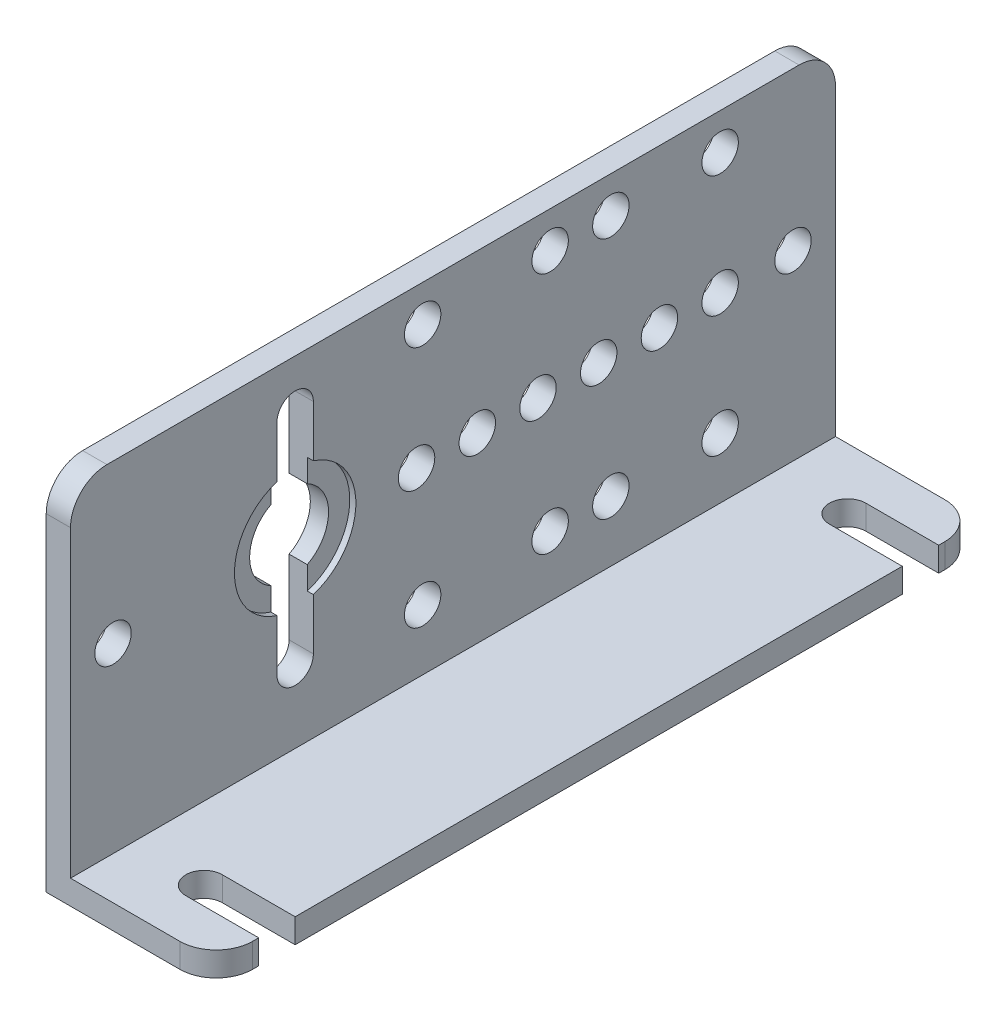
from build123d import *

# Parameters (mm, degrees)
EXTRUSION1_DEPTH           = 63
CONG_1_R                   = 3
ENL_V_MAT_EXTRU_1_DEPTH    = 72.168813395
R_P_TITION_LIN_AIRE1_COUNT = 2
R_P_TITION_LIN_AIRE1_PITCH = 53
ESQUISSE3_R                = 1.5
ENL_V_MAT_EXTRU_2_DEPTH    = 72.168813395
R_P_TITION_LIN_AIRE2_COUNT = 2
R_P_TITION_LIN_AIRE2_PITCH = 56
ESQUISSE4_R                = 1.5
ENL_V_MAT_EXTRU_3_DEPTH    = 72.168813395
R_P_TITION_LIN_AIRE3_COUNT = 6
R_P_TITION_LIN_AIRE3_PITCH = 5
ESQUISSE5_R                = 1.5
ENL_V_MAT_EXTRU_4_DEPTH    = 72.168813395
R_P_TITION_LIN_AIRE4_COUNT = 2
R_P_TITION_LIN_AIRE4_PITCH = 20
ENL_V_MAT_EXTRU_5_DEPTH    = 72.168813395
ESQUISSE7_R                = 5
ENL_V_MAT_EXTRU_6_DEPTH    = 0.5


with BuildPart() as part:
    # Esquisse1 → Extrusion1 (new body)
    with BuildSketch(Plane.XY):
        Polygon((0, 0), (14, 0), (14, 2), (2, 2), (2, 30), (0, 30), align=None)
    extrude(amount=EXTRUSION1_DEPTH)

    # Cong_1
    cong_1_edges = [part.edges().sort_by_distance(p)[0] for p in [
        (14, 1, 63),
        (1, 30, 63),
        (1, 30, 0),
        (14, 1, 0),
    ]]
    fillet(cong_1_edges, radius=CONG_1_R)

    # Esquisse2 → Enl_v. mat.-Extru.1 (cut, through all)
    with BuildSketch(Plane.XZ):
        with BuildLine():
            Line((14, 3.5), (8, 3.5))
            ThreePointArc((8, 3.5), (6.5, 5), (8, 6.5))
            Line((8, 6.5), (14, 6.5))
            Line((14, 6.5), (14, 3.5))
        make_face()
    enl_v_mat_extru_1 = extrude(amount=-ENL_V_MAT_EXTRU_1_DEPTH, mode=Mode.SUBTRACT)

    # R_p_tition lin_aire1: Enl_v. mat.-Extru.1 ×2
    with Locations(*[(0, 0, i * R_P_TITION_LIN_AIRE1_PITCH) for i in range(1, R_P_TITION_LIN_AIRE1_COUNT)]):
        add(enl_v_mat_extru_1, mode=Mode.SUBTRACT)

    # Esquisse3 → Enl_v. mat.-Extru.2 (cut, through all)
    with BuildSketch(Plane.ZY):
        with Locations(Location((3.5, 17, 0), (0, 0, 270))):
            Circle(ESQUISSE3_R)
    enl_v_mat_extru_2 = extrude(amount=-ENL_V_MAT_EXTRU_2_DEPTH, mode=Mode.SUBTRACT)

    # R_p_tition lin_aire2: Enl_v. mat.-Extru.2 ×2
    with Locations(*[(0, 0, i * R_P_TITION_LIN_AIRE2_PITCH) for i in range(1, R_P_TITION_LIN_AIRE2_COUNT)]):
        add(enl_v_mat_extru_2, mode=Mode.SUBTRACT)

    # Esquisse4 → Enl_v. mat.-Extru.3 (cut, through all)
    with BuildSketch(Plane.ZY):
        with Locations(Location((9.5, 17, 0), (0, 0, 270))):
            Circle(ESQUISSE4_R)
    enl_v_mat_extru_3 = extrude(amount=-ENL_V_MAT_EXTRU_3_DEPTH, mode=Mode.SUBTRACT)

    # R_p_tition lin_aire3: Enl_v. mat.-Extru.3 ×6
    with Locations(*[(0, 0, i * R_P_TITION_LIN_AIRE3_PITCH) for i in range(1, R_P_TITION_LIN_AIRE3_COUNT)]):
        add(enl_v_mat_extru_3, mode=Mode.SUBTRACT)

    # Esquisse5 → Enl_v. mat.-Extru.4 (cut, through all)
    with BuildSketch(Plane.ZY):
        with Locations(Location((9.5, 27, 0), (0, 0, 270))):
            Circle(ESQUISSE5_R)
        with Locations(Location((18.5, 27, 0), (0, 0, 270))):
            Circle(ESQUISSE5_R)
        with Locations(Location((23.5, 27, 0), (0, 0, 270))):
            Circle(ESQUISSE5_R)
        with Locations(Location((34, 27, 0), (0, 0, 270))):
            Circle(ESQUISSE5_R)
    enl_v_mat_extru_4 = extrude(amount=-ENL_V_MAT_EXTRU_4_DEPTH, mode=Mode.SUBTRACT)

    # R_p_tition lin_aire4: Enl_v. mat.-Extru.4 ×2
    with Locations(*[(0, -i * R_P_TITION_LIN_AIRE4_PITCH, 0) for i in range(1, R_P_TITION_LIN_AIRE4_COUNT)]):
        add(enl_v_mat_extru_4, mode=Mode.SUBTRACT)

    # Esquisse6 → Enl_v. mat.-Extru.5 (cut, through all)
    with BuildSketch(Plane.ZY):
        with BuildLine():
            Line((43, 14.116859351), (43, 8))
            ThreePointArc((43, 8), (44.5, 6.5), (46, 8))
            Line((46, 8), (46, 14.116859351))
            ThreePointArc((46, 14.116859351), (47.75, 17), (46, 19.883140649))
            Line((46, 19.883140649), (46, 26))
            ThreePointArc((46, 26), (44.5, 27.5), (43, 26))
            Line((43, 26), (43, 19.883140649))
            ThreePointArc((43, 19.883140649), (41.25, 17), (43, 14.116859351))
        make_face()
    extrude(amount=-ENL_V_MAT_EXTRU_5_DEPTH, mode=Mode.SUBTRACT)

    # Esquisse7 → Enl_v. mat.-Extru.6 (cut)
    with BuildSketch(Plane(origin=(2, 0, 0), x_dir=(0, 0, -1), z_dir=(1, 0, 0))):
        with Locations((-44.5, 17)):
            Circle(ESQUISSE7_R)
    extrude(amount=-ENL_V_MAT_EXTRU_6_DEPTH, mode=Mode.SUBTRACT)


solid = part.part
